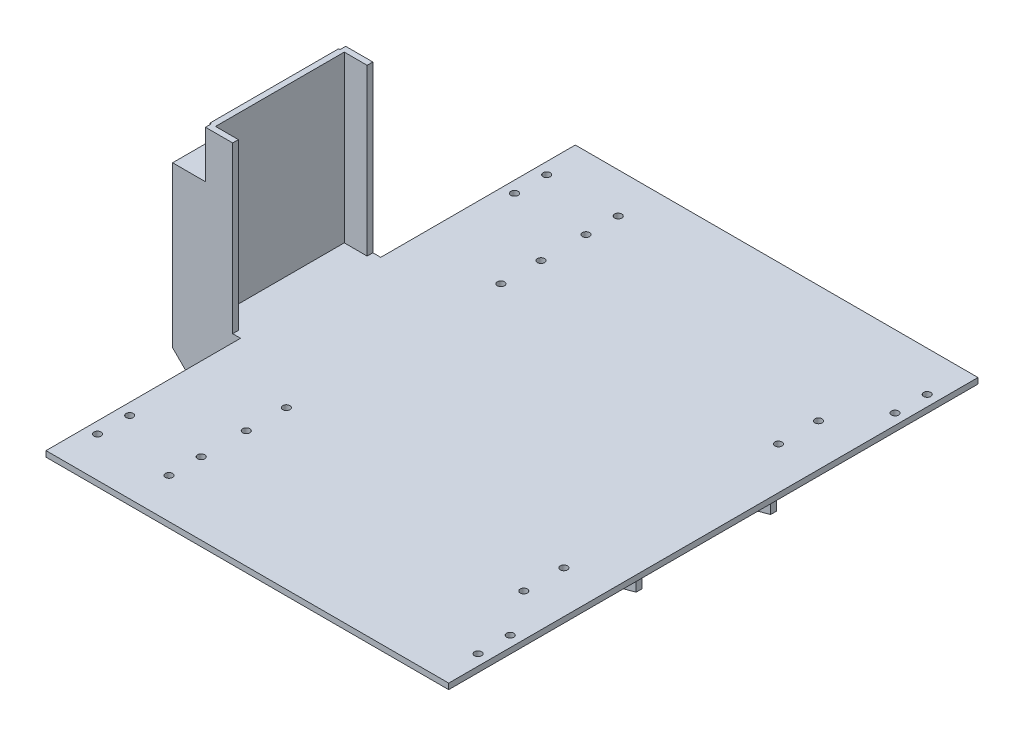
from build123d import *

# Parameters (mm, degrees)
LINEAR_AUSTRAGEN_D_NN1_DEPTH       = 49
SKIZZE2_W                          = 281.5
SKIZZE2_H                          = 370
AUFSATZ_LINEAR_AUSTRAGEN1_DEPTH    = 4
AUFSATZ_LINEAR_AUSTRAGEN2_DEPTH    = 4
AUFSATZ_LINEAR_AUSTRAGEN3_DEPTH    = 4
FASE1_SIZE                         = 14.5
SKIZZE5_W                          = 4
SKIZZE5_H                          = 90
AUFSATZ_LINEAR_AUSTRAGEN4_DEPTH    = 115.5
F_5_0_5_DURCHMESSER_BOHRUNG1_D     = 5
F_5_0_5_DURCHMESSER_BOHRUNG1_DEPTH = 42
F_5_0_5_DURCHMESSER_BOHRUNG1_TIP   = 1.502151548


with BuildPart() as part:
    # Skizze1 → Linear-Austragen-D_nn1 (new, symmetric)
    with BuildSketch(Plane.XY):
        Polygon((0, 0), (22, 0), (22, -82.5), (329, -82.5), (329, -86.5), (18, -86.5), (18, -4), (0, -4), align=None)
    extrude(amount=LINEAR_AUSTRAGEN_D_NN1_DEPTH, both=True)

    # Skizze2 → Aufsatz-Linear austragen1 (add)
    with BuildSketch(Plane(origin=(0, -82.5, 0), x_dir=(1, 0, 0), z_dir=(0, 1, 0))):
        with Locations((188.25, 0)):
            Rectangle(SKIZZE2_W, SKIZZE2_H)
    extrude(amount=-AUFSATZ_LINEAR_AUSTRAGEN1_DEPTH)

    # Skizze3 → Aufsatz-Linear austragen2 (add)
    with BuildSketch(Plane.XY.offset(49)):
        Polygon((0, 0), (0, -126.5), (217.636551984, -126.5), (324, -98), (324, -82.5), (42, -82.5), (42, 33), (23, 33), (23, 0), align=None)
    extrude(amount=-AUFSATZ_LINEAR_AUSTRAGEN2_DEPTH)

    # Skizze4 → Aufsatz-Linear austragen3 (add)
    with BuildSketch(Plane(origin=(0, 0, -49), x_dir=(-1, 0, 0), z_dir=(0, 0, -1))):
        Polygon((-23, 33), (-42, 33), (-42, -82.5), (-47.5, -82.5), (-47.5, -86.5), (-324, -86.5), (-324, -98), (-217.636551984, -126.5), (0, -126.5), (0, 0), (-23, 0), align=None)
    extrude(amount=-AUFSATZ_LINEAR_AUSTRAGEN3_DEPTH)

    # Fase1
    fase1_edges = [part.edges().sort_by_distance(p)[0] for p in [
        (0, -126.5, -47),
        (0, -126.5, 47),
    ]]
    chamfer(fase1_edges, length=FASE1_SIZE)

    # Skizze5 → Aufsatz-Linear austragen4 (add)
    with BuildSketch(Plane(origin=(0, -82.5, 0), x_dir=(1, 0, 0), z_dir=(0, 1, 0))):
        with Locations((24, 0)):
            Rectangle(SKIZZE5_W, SKIZZE5_H)
    extrude(amount=AUFSATZ_LINEAR_AUSTRAGEN4_DEPTH)

    # 5.0 _5_ Durchmesser Bohrung1
    with Locations(Plane(origin=(0, -82.5, 0), x_dir=(1, 0, 0), z_dir=(0, 1, 0))):
        with Locations((55.5, 157), (105.5, 157), (105.5, 134.5), (55.5, 134.5), (105.5, 103), (105.5, 75), (299.5, 75), (299.5, 103), (321.5, 134.5), (321.5, 157), (299.5, -75), (299.5, -103), (321.5, -134.5), (321.5, -157), (105.5, -157), (105.5, -134.5), (105.5, -103), (105.5, -75), (55.5, -134.5), (55.5, -157)):
            Hole(F_5_0_5_DURCHMESSER_BOHRUNG1_D / 2, depth=F_5_0_5_DURCHMESSER_BOHRUNG1_DEPTH)
            with Locations((0, 0, -(F_5_0_5_DURCHMESSER_BOHRUNG1_DEPTH + F_5_0_5_DURCHMESSER_BOHRUNG1_TIP / 2))):  # 118° drill point
                Cone(0, F_5_0_5_DURCHMESSER_BOHRUNG1_D / 2, F_5_0_5_DURCHMESSER_BOHRUNG1_TIP, mode=Mode.SUBTRACT)


solid = part.part
